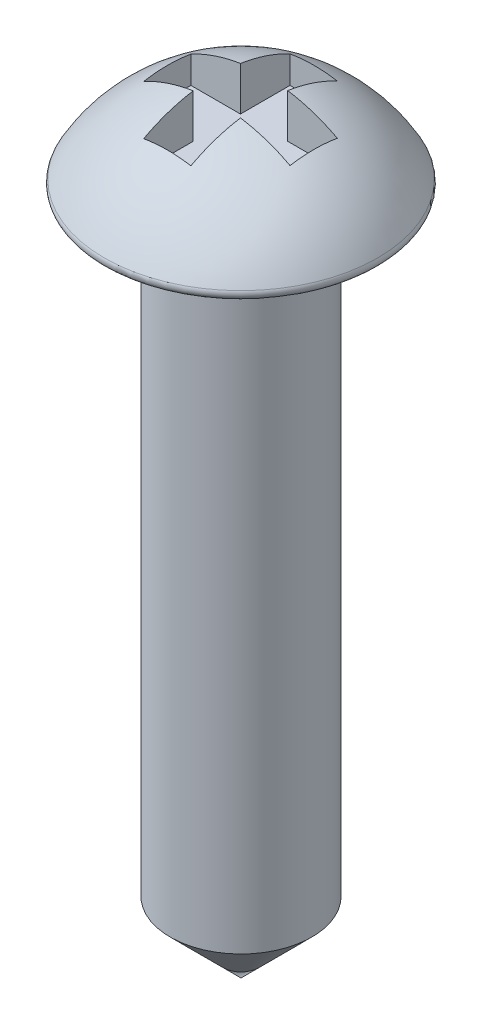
from build123d import *

# Parameters (mm, degrees)
CONG_1_R                = 0.1
ENL_V_MAT_EXTRU_1_DEPTH = 0.5


with BuildPart() as part:
    # Esquisse1 → R_volution1 (revolve)
    with BuildSketch(Plane.XY, mode=Mode.PRIVATE) as r_volution1_sk:
        with BuildLine():
            Line((2.2, 0), (1.1, 0))
            Line((1.1, 0), (1.1, -9.5))
            Line((1.1, -9.5), (0, -10.6))
            Line((0, -10.6), (0, 1.392961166))
            ThreePointArc((0, 1.392961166), (1.301954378, 1.015441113), (2.2, 0))
        make_face()
    revolve(r_volution1_sk.sketch.rotate(Axis((0, 3.800054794, 0), (0, -1, 0)), 180), axis=Axis((0, 3.800054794, 0), (0, -1, 0)))

    # Cong_1
    cong_1_edges = [part.edges().sort_by_distance(p)[0] for p in [
        (2.2, 0, 0),
    ]]
    fillet(cong_1_edges, radius=CONG_1_R)

    # Esquisse2 → Enl_v. mat.-Extru.1 (cut, symmetric)
    with BuildSketch(Plane(origin=(0, 1.15653742, 0), x_dir=(-1, 0, 0), z_dir=(0, 1, 0))):
        Polygon((-0.361948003, 1.140760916), (0.37159995, 1.140760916), (0.37159995, 0.37038863), (1.141972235, 0.37038863), (1.141972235, -0.363159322), (0.37159995, -0.363159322), (0.37159995, -1.133531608), (-0.361948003, -1.133531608), (-0.361948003, -0.363159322), (-1.132320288, -0.363159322), (-1.132320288, 0.37038863), (-0.361948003, 0.37038863), align=None)
    extrude(amount=ENL_V_MAT_EXTRU_1_DEPTH, both=True, mode=Mode.SUBTRACT)


solid = part.part
